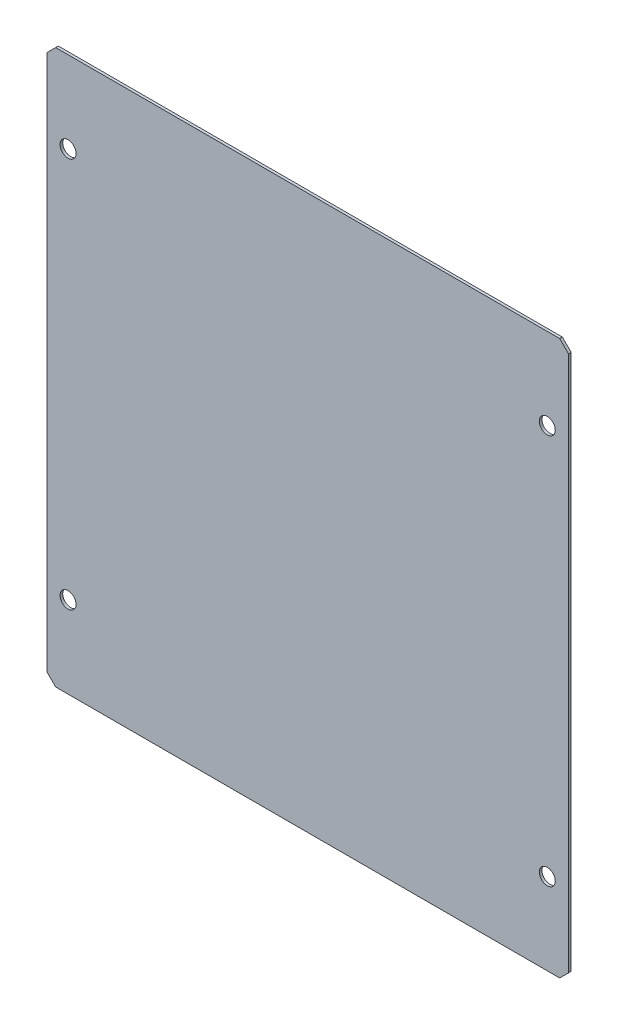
from build123d import *

# Parameters (mm, degrees)
SKETCH1_W                 = 294
SKETCH1_H                 = 312
BOSS_EXTRUDE1_DEPTH       = 1.5
SKETCH9_W                 = 4.5
SKETCH9_H                 = 2.7
DIAMETER_HOLE2_AT_2_COUNT = 2
DIAMETER_HOLE2_AT_2_PITCH = 220
DIAMETER_HOLE2_AT_3_COUNT = 2
DIAMETER_HOLE2_AT_3_PITCH = 270
DIAMETER_HOLE2_AT_4_COUNT = 2
DIAMETER_HOLE2_AT_4_PITCH = 348.281495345
CHAMFER1_SIZE             = 5


with BuildPart() as part:
    # Sketch1 → Boss-Extrude1 (new body)
    with BuildSketch(Plane.XY):
        with Locations((147, 156)):
            Rectangle(SKETCH1_W, SKETCH1_H)
    extrude(amount=BOSS_EXTRUDE1_DEPTH)

    # Sketch9 → Diameter Hole2 (revolve, cut)
    with BuildSketch(Plane(origin=(12, 266, 1.5), x_dir=(0, -1, 0), z_dir=(1, 0, 0))):
        with Locations((2.25, 0.15)):
            Rectangle(SKETCH9_W, SKETCH9_H)
    diameter_hole2 = revolve(axis=Axis((12, 266, 2.7), (0, 0, -1)), mode=Mode.SUBTRACT)

    # Diameter Hole2 at 2: Diameter Hole2 ×2
    with Locations(*[(0, -i * DIAMETER_HOLE2_AT_2_PITCH, 0) for i in range(1, DIAMETER_HOLE2_AT_2_COUNT)]):
        add(diameter_hole2, mode=Mode.SUBTRACT)

    # Diameter Hole2 at 3: Diameter Hole2 ×2
    with Locations(*[(i * DIAMETER_HOLE2_AT_3_PITCH, 0, 0) for i in range(1, DIAMETER_HOLE2_AT_3_COUNT)]):
        add(diameter_hole2, mode=Mode.SUBTRACT)

    # Diameter Hole2 at 4: Diameter Hole2 ×2
    with Locations(*[Vector(0.7752349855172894, -0.6316729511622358, 0) * (i * DIAMETER_HOLE2_AT_4_PITCH) for i in range(1, DIAMETER_HOLE2_AT_4_COUNT)]):
        add(diameter_hole2, mode=Mode.SUBTRACT)

    # Chamfer1
    chamfer1_edges = [part.edges().sort_by_distance(p)[0] for p in [
        (0, 312, 0.75),
        (294, 312, 0.75),
        (294, 0, 0.75),
        (0, 0, 0.75),
    ]]
    chamfer(chamfer1_edges, length=CHAMFER1_SIZE)


solid = part.part
